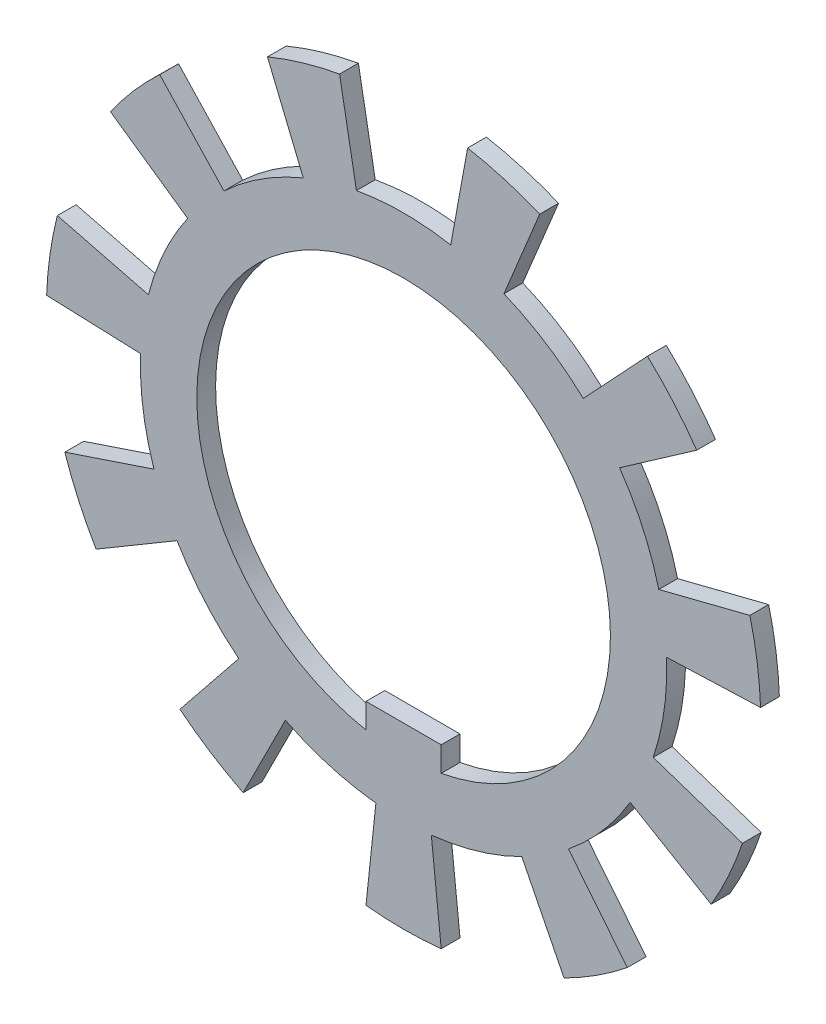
from build123d import *

# Parameters (mm, degrees)
BODYSKE_W      = 8
BODYSKE_H      = 1
TOOTHCUT_DEPTH = 27.888659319
TOOTHPAT_COUNT = 11
LOCKBODYSKE_W  = 4
LOCKBODYSKE_H  = 2
LOCKBODY_DEPTH = 1


with BuildPart() as part:
    # BodySke → BaseBody (revolve)
    with BuildSketch(Plane(origin=(0, 0, 0), x_dir=(1, 0, 0), z_dir=(0, 1, 0))):
        with Locations((15, 0.5)):
            Rectangle(BODYSKE_W, BODYSKE_H)
    revolve(axis=Axis((0, 0, 0), (0, 0, -1)))

    # ToothSke → ToothCut (cut, through all)
    with BuildSketch(Plane.XY):
        with BuildLine():
            Line((-2.508353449, 13.773458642), (-3.404193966, 18.692551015))
            ThreePointArc((-3.404193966, 18.692551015), (0, 19), (3.404193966, 18.692551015))
            Line((3.404193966, 18.692551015), (2.508353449, 13.773458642))
            ThreePointArc((2.508353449, 13.773458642), (0, 14), (-2.508353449, 13.773458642))
        make_face()
    toothcut = extrude(amount=-TOOTHCUT_DEPTH, mode=Mode.SUBTRACT)

    # ToothPat: ToothCut ×11 about axis
    toothpat_axis = Axis((0, 0, 0), (0, 0, 1))
    for i in range(1, TOOTHPAT_COUNT):
        add(toothcut.rotate(toothpat_axis, i * 360 / TOOTHPAT_COUNT), mode=Mode.SUBTRACT)

    # LockBodySke → LockBody (add)
    with BuildSketch(Plane.XY):
        with Locations((0, -10.5)):
            Rectangle(LOCKBODYSKE_W, LOCKBODYSKE_H)
    extrude(amount=-LOCKBODY_DEPTH)


solid = part.part
